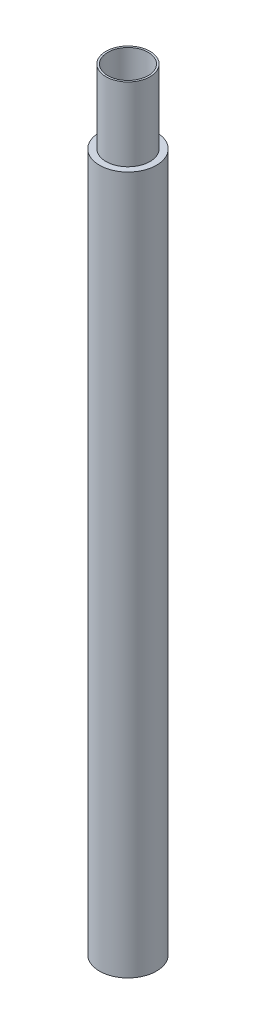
from build123d import *

# Parameters (mm, degrees)
COQUE1_T                = -5
ENL_V_START             = -10
ESQUISSE2_R             = 72.5
ENL_V_MAT_EXTRU_1_DEPTH = 10


with BuildPart() as part:
    # Esquisse1 → R_volution1 (revolve)
    with BuildSketch(Plane.XY):
        Polygon((70, 1150), (70, -950), (-7.5, -950), (-7.5, 950), (10, 950), (10, 1150), align=None)
    revolve(axis=Axis((70, 1150, 0), (0, -1, 0)))

    # Coque1
    coque1_openings = [part.faces().sort_by_distance(p)[0] for p in [
        (70, 1150, 0),
    ]]
    offset(amount=COQUE1_T, openings=coque1_openings, kind=Kind.INTERSECTION)

    # Esquisse2 → Enl_v. mat.-Extru.1 (cut)
    with BuildSketch(Plane(origin=(0, -950, 0), x_dir=(-1, 0, 0), z_dir=(0, -1, 0)).offset(ENL_V_START)):
        with Locations((-70, 0)):
            Circle(ESQUISSE2_R)
    extrude(amount=ENL_V_MAT_EXTRU_1_DEPTH, mode=Mode.SUBTRACT)


solid = part.part
